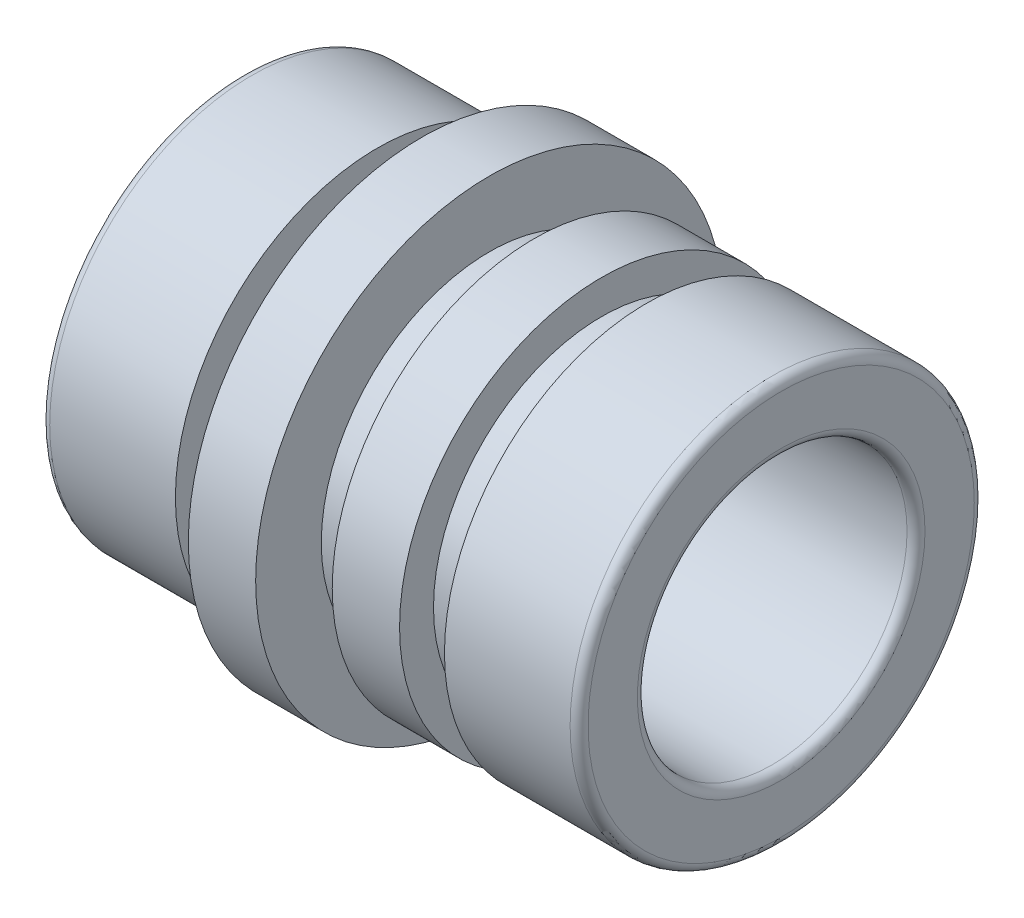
ISO-10303-21;
HEADER;
FILE_DESCRIPTION(('STEP AP214'),'2;1');
FILE_NAME('part.step','',(''),(''),'','','');
FILE_SCHEMA(('AUTOMOTIVE_DESIGN { 1 0 10303 214 1 1 1 1 }'));
ENDSEC;
DATA;
#1=APPLICATION_CONTEXT('core data for automotive mechanical design processes');
#2=APPLICATION_PROTOCOL_DEFINITION('international standard','automotive_design',2000,#1);
#3=PRODUCT_CONTEXT('',#1,'mechanical');
#4=PRODUCT('Part','Part','',(#3));
#5=PRODUCT_RELATED_PRODUCT_CATEGORY('part','',(#4));
#6=PRODUCT_DEFINITION_FORMATION('','',#4);
#7=PRODUCT_DEFINITION_CONTEXT('part definition',#1,'design');
#8=PRODUCT_DEFINITION('design','',#6,#7);
#9=PRODUCT_DEFINITION_SHAPE('','',#8);
#10=(LENGTH_UNIT() NAMED_UNIT(*) SI_UNIT(.MILLI.,.METRE.));
#11=(NAMED_UNIT(*) PLANE_ANGLE_UNIT() SI_UNIT($,.RADIAN.));
#12=(NAMED_UNIT(*) SI_UNIT($,.STERADIAN.) SOLID_ANGLE_UNIT());
#13=UNCERTAINTY_MEASURE_WITH_UNIT(LENGTH_MEASURE(1.E-05),#10,'distance_accuracy_value','');
#14=(GEOMETRIC_REPRESENTATION_CONTEXT(3) GLOBAL_UNCERTAINTY_ASSIGNED_CONTEXT((#13)) GLOBAL_UNIT_ASSIGNED_CONTEXT((#10,
#11,#12)) REPRESENTATION_CONTEXT('',''));
#15=CARTESIAN_POINT('',(0.,0.,0.));
#16=DIRECTION('',(0.,0.,1.));
#17=DIRECTION('',(1.,0.,0.));
#18=AXIS2_PLACEMENT_3D('',#15,#16,#17);
#19=CARTESIAN_POINT('',(-12.7,9.53770000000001,0.));
#20=DIRECTION('',(-1.,0.,0.));
#21=DIRECTION('',(0.,0.,1.));
#22=AXIS2_PLACEMENT_3D('',#19,#20,#21);
#23=PLANE('',#22);
#24=CARTESIAN_POINT('',(-12.7,0.,0.));
#25=DIRECTION('',(-1.,0.,0.));
#26=DIRECTION('',(0.,0.,1.));
#27=AXIS2_PLACEMENT_3D('',#24,#25,#26);
#28=CIRCLE('',#27,13.6398);
#29=CARTESIAN_POINT('',(-12.7,0.,13.6398));
#30=VERTEX_POINT('',#29);
#31=EDGE_CURVE('E38',#30,#30,#28,.T.);
#32=ORIENTED_EDGE('',*,*,#31,.T.);
#33=EDGE_LOOP('',(#32));
#34=FACE_BOUND('',#33,.T.);
#35=CARTESIAN_POINT('',(-12.7,0.,0.));
#36=DIRECTION('',(-1.,0.,0.));
#37=DIRECTION('',(0.,0.,1.));
#38=AXIS2_PLACEMENT_3D('',#35,#36,#37);
#39=CIRCLE('',#38,10.1727);
#40=CARTESIAN_POINT('',(-12.7,0.,10.1727));
#41=VERTEX_POINT('',#40);
#42=EDGE_CURVE('E42',#41,#41,#39,.F.);
#43=ORIENTED_EDGE('',*,*,#42,.T.);
#44=EDGE_LOOP('',(#43));
#45=FACE_BOUND('',#44,.T.);
#46=ADVANCED_FACE('F31',(#34,#45),#23,.T.);
#47=CARTESIAN_POINT('',(-36.83,0.,0.));
#48=DIRECTION('',(-1.,0.,0.));
#49=DIRECTION('',(0.,0.,1.));
#50=AXIS2_PLACEMENT_3D('',#47,#48,#49);
#51=CYLINDRICAL_SURFACE('',#50,9.5377);
#52=CARTESIAN_POINT('',(24.765,0.,0.));
#53=DIRECTION('',(1.,0.,0.));
#54=DIRECTION('',(0.,0.,-1.));
#55=AXIS2_PLACEMENT_3D('',#52,#53,#54);
#56=CIRCLE('',#55,9.5377);
#57=CARTESIAN_POINT('',(24.765,0.,-9.5377));
#58=VERTEX_POINT('',#57);
#59=EDGE_CURVE('E46',#58,#58,#56,.T.);
#60=ORIENTED_EDGE('',*,*,#59,.T.);
#61=EDGE_LOOP('',(#60));
#62=FACE_BOUND('',#61,.T.);
#63=CARTESIAN_POINT('',(-12.065,0.,0.));
#64=DIRECTION('',(-1.,0.,0.));
#65=DIRECTION('',(0.,0.,1.));
#66=AXIS2_PLACEMENT_3D('',#63,#64,#65);
#67=CIRCLE('',#66,9.5377);
#68=CARTESIAN_POINT('',(-12.065,0.,9.5377));
#69=VERTEX_POINT('',#68);
#70=EDGE_CURVE('E51',#69,#69,#67,.T.);
#71=ORIENTED_EDGE('',*,*,#70,.T.);
#72=EDGE_LOOP('',(#71));
#73=FACE_BOUND('',#72,.T.);
#74=ADVANCED_FACE('F117',(#62,#73),#51,.F.);
#75=CARTESIAN_POINT('',(25.4,14.29385,0.));
#76=DIRECTION('',(1.,0.,0.));
#77=DIRECTION('',(0.,0.,-1.));
#78=AXIS2_PLACEMENT_3D('',#75,#76,#77);
#79=PLANE('',#78);
#80=CARTESIAN_POINT('',(25.4,0.,0.));
#81=DIRECTION('',(1.,0.,0.));
#82=DIRECTION('',(0.,0.,-1.));
#83=AXIS2_PLACEMENT_3D('',#80,#81,#82);
#84=CIRCLE('',#83,13.65885);
#85=CARTESIAN_POINT('',(25.4,0.,-13.65885));
#86=VERTEX_POINT('',#85);
#87=EDGE_CURVE('E54',#86,#86,#84,.T.);
#88=ORIENTED_EDGE('',*,*,#87,.T.);
#89=EDGE_LOOP('',(#88));
#90=FACE_BOUND('',#89,.T.);
#91=CARTESIAN_POINT('',(25.4,0.,0.));
#92=DIRECTION('',(1.,0.,0.));
#93=DIRECTION('',(0.,0.,-1.));
#94=AXIS2_PLACEMENT_3D('',#91,#92,#93);
#95=CIRCLE('',#94,10.1727);
#96=CARTESIAN_POINT('',(25.4,0.,-10.1727));
#97=VERTEX_POINT('',#96);
#98=EDGE_CURVE('E57',#97,#97,#95,.F.);
#99=ORIENTED_EDGE('',*,*,#98,.T.);
#100=EDGE_LOOP('',(#99));
#101=FACE_BOUND('',#100,.T.);
#102=ADVANCED_FACE('F122',(#90,#101),#79,.T.);
#103=CARTESIAN_POINT('',(-36.83,0.,0.));
#104=DIRECTION('',(-1.,0.,0.));
#105=DIRECTION('',(0.,0.,1.));
#106=AXIS2_PLACEMENT_3D('',#103,#104,#105);
#107=CYLINDRICAL_SURFACE('',#106,14.29385);
#108=CARTESIAN_POINT('',(24.765,0.,0.));
#109=DIRECTION('',(1.,0.,0.));
#110=DIRECTION('',(0.,0.,-1.));
#111=AXIS2_PLACEMENT_3D('',#108,#109,#110);
#112=CIRCLE('',#111,14.29385);
#113=CARTESIAN_POINT('',(24.765,0.,-14.29385));
#114=VERTEX_POINT('',#113);
#115=EDGE_CURVE('E60',#114,#114,#112,.F.);
#116=ORIENTED_EDGE('',*,*,#115,.T.);
#117=EDGE_LOOP('',(#116));
#118=FACE_BOUND('',#117,.T.);
#119=CARTESIAN_POINT('',(15.875,0.,0.));
#120=DIRECTION('',(-1.,0.,0.));
#121=DIRECTION('',(0.,0.,1.));
#122=AXIS2_PLACEMENT_3D('',#119,#120,#121);
#123=CIRCLE('',#122,14.29385);
#124=CARTESIAN_POINT('',(15.875,0.,14.29385));
#125=VERTEX_POINT('',#124);
#126=EDGE_CURVE('E63',#125,#125,#123,.T.);
#127=ORIENTED_EDGE('',*,*,#126,.F.);
#128=EDGE_LOOP('',(#127));
#129=FACE_BOUND('',#128,.T.);
#130=ADVANCED_FACE('F176',(#118,#129),#107,.T.);
#131=CARTESIAN_POINT('',(15.875,11.89355,0.));
#132=DIRECTION('',(-1.,0.,0.));
#133=DIRECTION('',(0.,0.,1.));
#134=AXIS2_PLACEMENT_3D('',#131,#132,#133);
#135=PLANE('',#134);
#136=ORIENTED_EDGE('',*,*,#126,.T.);
#137=EDGE_LOOP('',(#136));
#138=FACE_BOUND('',#137,.T.);
#139=CARTESIAN_POINT('',(15.875,0.,0.));
#140=DIRECTION('',(-1.,0.,0.));
#141=DIRECTION('',(0.,0.,1.));
#142=AXIS2_PLACEMENT_3D('',#139,#140,#141);
#143=CIRCLE('',#142,11.89355);
#144=CARTESIAN_POINT('',(15.875,0.,11.89355));
#145=VERTEX_POINT('',#144);
#146=EDGE_CURVE('E66',#145,#145,#143,.T.);
#147=ORIENTED_EDGE('',*,*,#146,.F.);
#148=EDGE_LOOP('',(#147));
#149=FACE_BOUND('',#148,.T.);
#150=ADVANCED_FACE('F181',(#138,#149),#135,.T.);
#151=CARTESIAN_POINT('',(-36.83,0.,0.));
#152=DIRECTION('',(-1.,0.,0.));
#153=DIRECTION('',(0.,0.,1.));
#154=AXIS2_PLACEMENT_3D('',#151,#152,#153);
#155=CYLINDRICAL_SURFACE('',#154,11.89355);
#156=ORIENTED_EDGE('',*,*,#146,.T.);
#157=EDGE_LOOP('',(#156));
#158=FACE_BOUND('',#157,.T.);
#159=CARTESIAN_POINT('',(12.7,0.,0.));
#160=DIRECTION('',(-1.,0.,0.));
#161=DIRECTION('',(0.,0.,1.));
#162=AXIS2_PLACEMENT_3D('',#159,#160,#161);
#163=CIRCLE('',#162,11.89355);
#164=CARTESIAN_POINT('',(12.7,0.,11.89355));
#165=VERTEX_POINT('',#164);
#166=EDGE_CURVE('E69',#165,#165,#163,.T.);
#167=ORIENTED_EDGE('',*,*,#166,.F.);
#168=EDGE_LOOP('',(#167));
#169=FACE_BOUND('',#168,.T.);
#170=ADVANCED_FACE('F280',(#158,#169),#155,.T.);
#171=CARTESIAN_POINT('',(12.7,14.29385,0.));
#172=DIRECTION('',(1.,0.,0.));
#173=DIRECTION('',(0.,0.,-1.));
#174=AXIS2_PLACEMENT_3D('',#171,#172,#173);
#175=PLANE('',#174);
#176=ORIENTED_EDGE('',*,*,#166,.T.);
#177=EDGE_LOOP('',(#176));
#178=FACE_BOUND('',#177,.T.);
#179=CARTESIAN_POINT('',(12.7,0.,0.));
#180=DIRECTION('',(-1.,0.,0.));
#181=DIRECTION('',(0.,0.,1.));
#182=AXIS2_PLACEMENT_3D('',#179,#180,#181);
#183=CIRCLE('',#182,14.29385);
#184=CARTESIAN_POINT('',(12.7,0.,14.29385));
#185=VERTEX_POINT('',#184);
#186=EDGE_CURVE('E72',#185,#185,#183,.T.);
#187=ORIENTED_EDGE('',*,*,#186,.F.);
#188=EDGE_LOOP('',(#187));
#189=FACE_BOUND('',#188,.T.);
#190=ADVANCED_FACE('F270',(#178,#189),#175,.T.);
#191=CARTESIAN_POINT('',(-36.83,0.,0.));
#192=DIRECTION('',(-1.,0.,0.));
#193=DIRECTION('',(0.,0.,1.));
#194=AXIS2_PLACEMENT_3D('',#191,#192,#193);
#195=CYLINDRICAL_SURFACE('',#194,14.29385);
#196=ORIENTED_EDGE('',*,*,#186,.T.);
#197=EDGE_LOOP('',(#196));
#198=FACE_BOUND('',#197,.T.);
#199=CARTESIAN_POINT('',(7.9375,0.,0.));
#200=DIRECTION('',(-1.,0.,0.));
#201=DIRECTION('',(0.,0.,1.));
#202=AXIS2_PLACEMENT_3D('',#199,#200,#201);
#203=CIRCLE('',#202,14.29385);
#204=CARTESIAN_POINT('',(7.9375,0.,14.29385));
#205=VERTEX_POINT('',#204);
#206=EDGE_CURVE('E75',#205,#205,#203,.T.);
#207=ORIENTED_EDGE('',*,*,#206,.F.);
#208=EDGE_LOOP('',(#207));
#209=FACE_BOUND('',#208,.T.);
#210=ADVANCED_FACE('F260',(#198,#209),#195,.T.);
#211=CARTESIAN_POINT('',(7.9375,11.89355,0.));
#212=DIRECTION('',(-1.,0.,0.));
#213=DIRECTION('',(0.,0.,1.));
#214=AXIS2_PLACEMENT_3D('',#211,#212,#213);
#215=PLANE('',#214);
#216=ORIENTED_EDGE('',*,*,#206,.T.);
#217=EDGE_LOOP('',(#216));
#218=FACE_BOUND('',#217,.T.);
#219=CARTESIAN_POINT('',(7.9375,0.,0.));
#220=DIRECTION('',(-1.,0.,0.));
#221=DIRECTION('',(0.,0.,1.));
#222=AXIS2_PLACEMENT_3D('',#219,#220,#221);
#223=CIRCLE('',#222,11.89355);
#224=CARTESIAN_POINT('',(7.9375,0.,11.89355));
#225=VERTEX_POINT('',#224);
#226=EDGE_CURVE('E78',#225,#225,#223,.T.);
#227=ORIENTED_EDGE('',*,*,#226,.F.);
#228=EDGE_LOOP('',(#227));
#229=FACE_BOUND('',#228,.T.);
#230=ADVANCED_FACE('F250',(#218,#229),#215,.T.);
#231=CARTESIAN_POINT('',(-36.83,0.,0.));
#232=DIRECTION('',(-1.,0.,0.));
#233=DIRECTION('',(0.,0.,1.));
#234=AXIS2_PLACEMENT_3D('',#231,#232,#233);
#235=CYLINDRICAL_SURFACE('',#234,11.89355);
#236=ORIENTED_EDGE('',*,*,#226,.T.);
#237=EDGE_LOOP('',(#236));
#238=FACE_BOUND('',#237,.T.);
#239=CARTESIAN_POINT('',(4.7625,0.,0.));
#240=DIRECTION('',(-1.,0.,0.));
#241=DIRECTION('',(0.,0.,1.));
#242=AXIS2_PLACEMENT_3D('',#239,#240,#241);
#243=CIRCLE('',#242,11.89355);
#244=CARTESIAN_POINT('',(4.7625,0.,11.89355));
#245=VERTEX_POINT('',#244);
#246=EDGE_CURVE('E81',#245,#245,#243,.T.);
#247=ORIENTED_EDGE('',*,*,#246,.F.);
#248=EDGE_LOOP('',(#247));
#249=FACE_BOUND('',#248,.T.);
#250=ADVANCED_FACE('F240',(#238,#249),#235,.T.);
#251=CARTESIAN_POINT('',(4.7625,16.5354,0.));
#252=DIRECTION('',(1.,0.,0.));
#253=DIRECTION('',(0.,0.,-1.));
#254=AXIS2_PLACEMENT_3D('',#251,#252,#253);
#255=PLANE('',#254);
#256=ORIENTED_EDGE('',*,*,#246,.T.);
#257=EDGE_LOOP('',(#256));
#258=FACE_BOUND('',#257,.T.);
#259=CARTESIAN_POINT('',(4.7625,0.,0.));
#260=DIRECTION('',(-1.,0.,0.));
#261=DIRECTION('',(0.,0.,1.));
#262=AXIS2_PLACEMENT_3D('',#259,#260,#261);
#263=CIRCLE('',#262,16.5354);
#264=CARTESIAN_POINT('',(4.7625,0.,16.5354));
#265=VERTEX_POINT('',#264);
#266=EDGE_CURVE('E84',#265,#265,#263,.T.);
#267=ORIENTED_EDGE('',*,*,#266,.F.);
#268=EDGE_LOOP('',(#267));
#269=FACE_BOUND('',#268,.T.);
#270=ADVANCED_FACE('F230',(#258,#269),#255,.T.);
#271=CARTESIAN_POINT('',(-36.83,0.,0.));
#272=DIRECTION('',(-1.,0.,0.));
#273=DIRECTION('',(0.,0.,1.));
#274=AXIS2_PLACEMENT_3D('',#271,#272,#273);
#275=CYLINDRICAL_SURFACE('',#274,16.5354);
#276=ORIENTED_EDGE('',*,*,#266,.T.);
#277=EDGE_LOOP('',(#276));
#278=FACE_BOUND('',#277,.T.);
#279=CARTESIAN_POINT('',(0.,0.,0.));
#280=DIRECTION('',(-1.,0.,0.));
#281=DIRECTION('',(0.,0.,1.));
#282=AXIS2_PLACEMENT_3D('',#279,#280,#281);
#283=CIRCLE('',#282,16.5354);
#284=CARTESIAN_POINT('',(0.,0.,16.5354));
#285=VERTEX_POINT('',#284);
#286=EDGE_CURVE('E87',#285,#285,#283,.T.);
#287=ORIENTED_EDGE('',*,*,#286,.F.);
#288=EDGE_LOOP('',(#287));
#289=FACE_BOUND('',#288,.T.);
#290=ADVANCED_FACE('F220',(#278,#289),#275,.T.);
#291=CARTESIAN_POINT('',(0.,11.89355,0.));
#292=DIRECTION('',(-1.,0.,0.));
#293=DIRECTION('',(0.,0.,1.));
#294=AXIS2_PLACEMENT_3D('',#291,#292,#293);
#295=PLANE('',#294);
#296=ORIENTED_EDGE('',*,*,#286,.T.);
#297=EDGE_LOOP('',(#296));
#298=FACE_BOUND('',#297,.T.);
#299=CARTESIAN_POINT('',(0.,0.,0.));
#300=DIRECTION('',(-1.,0.,0.));
#301=DIRECTION('',(0.,0.,1.));
#302=AXIS2_PLACEMENT_3D('',#299,#300,#301);
#303=CIRCLE('',#302,11.89355);
#304=CARTESIAN_POINT('',(0.,0.,11.89355));
#305=VERTEX_POINT('',#304);
#306=EDGE_CURVE('E90',#305,#305,#303,.T.);
#307=ORIENTED_EDGE('',*,*,#306,.F.);
#308=EDGE_LOOP('',(#307));
#309=FACE_BOUND('',#308,.T.);
#310=ADVANCED_FACE('F113',(#298,#309),#295,.T.);
#311=CARTESIAN_POINT('',(-36.83,0.,0.));
#312=DIRECTION('',(-1.,0.,0.));
#313=DIRECTION('',(0.,0.,1.));
#314=AXIS2_PLACEMENT_3D('',#311,#312,#313);
#315=CYLINDRICAL_SURFACE('',#314,11.89355);
#316=ORIENTED_EDGE('',*,*,#306,.T.);
#317=EDGE_LOOP('',(#316));
#318=FACE_BOUND('',#317,.T.);
#319=CARTESIAN_POINT('',(-3.175,0.,0.));
#320=DIRECTION('',(-1.,0.,0.));
#321=DIRECTION('',(0.,0.,1.));
#322=AXIS2_PLACEMENT_3D('',#319,#320,#321);
#323=CIRCLE('',#322,11.89355);
#324=CARTESIAN_POINT('',(-3.175,0.,11.89355));
#325=VERTEX_POINT('',#324);
#326=EDGE_CURVE('E93',#325,#325,#323,.T.);
#327=ORIENTED_EDGE('',*,*,#326,.F.);
#328=EDGE_LOOP('',(#327));
#329=FACE_BOUND('',#328,.T.);
#330=ADVANCED_FACE('F104',(#318,#329),#315,.T.);
#331=CARTESIAN_POINT('',(-3.175,14.2748,0.));
#332=DIRECTION('',(1.,0.,0.));
#333=DIRECTION('',(0.,0.,-1.));
#334=AXIS2_PLACEMENT_3D('',#331,#332,#333);
#335=PLANE('',#334);
#336=ORIENTED_EDGE('',*,*,#326,.T.);
#337=EDGE_LOOP('',(#336));
#338=FACE_BOUND('',#337,.T.);
#339=CARTESIAN_POINT('',(-3.175,0.,0.));
#340=DIRECTION('',(-1.,0.,0.));
#341=DIRECTION('',(0.,0.,1.));
#342=AXIS2_PLACEMENT_3D('',#339,#340,#341);
#343=CIRCLE('',#342,14.2748);
#344=CARTESIAN_POINT('',(-3.175,0.,14.2748));
#345=VERTEX_POINT('',#344);
#346=EDGE_CURVE('E96',#345,#345,#343,.T.);
#347=ORIENTED_EDGE('',*,*,#346,.F.);
#348=EDGE_LOOP('',(#347));
#349=FACE_BOUND('',#348,.T.);
#350=ADVANCED_FACE('F102',(#338,#349),#335,.T.);
#351=CARTESIAN_POINT('',(-36.83,0.,0.));
#352=DIRECTION('',(-1.,0.,0.));
#353=DIRECTION('',(0.,0.,1.));
#354=AXIS2_PLACEMENT_3D('',#351,#352,#353);
#355=CYLINDRICAL_SURFACE('',#354,14.2748);
#356=CARTESIAN_POINT('',(-12.065,0.,0.));
#357=DIRECTION('',(-1.,0.,0.));
#358=DIRECTION('',(0.,0.,1.));
#359=AXIS2_PLACEMENT_3D('',#356,#357,#358);
#360=CIRCLE('',#359,14.2748);
#361=CARTESIAN_POINT('',(-12.065,0.,14.2748));
#362=VERTEX_POINT('',#361);
#363=EDGE_CURVE('E10',#362,#362,#360,.F.);
#364=ORIENTED_EDGE('',*,*,#363,.T.);
#365=EDGE_LOOP('',(#364));
#366=FACE_BOUND('',#365,.T.);
#367=ORIENTED_EDGE('',*,*,#346,.T.);
#368=EDGE_LOOP('',(#367));
#369=FACE_BOUND('',#368,.T.);
#370=ADVANCED_FACE('F100',(#366,#369),#355,.T.);
#371=CARTESIAN_POINT('',(24.765,0.,0.));
#372=DIRECTION('',(1.,0.,0.));
#373=DIRECTION('',(0.,0.,-1.));
#374=AXIS2_PLACEMENT_3D('',#371,#372,#373);
#375=TOROIDAL_SURFACE('',#374,13.65885,0.635);
#376=ORIENTED_EDGE('',*,*,#87,.F.);
#377=EDGE_LOOP('',(#376));
#378=FACE_BOUND('',#377,.T.);
#379=ORIENTED_EDGE('',*,*,#115,.F.);
#380=EDGE_LOOP('',(#379));
#381=FACE_BOUND('',#380,.T.);
#382=ADVANCED_FACE('F111',(#378,#381),#375,.T.);
#383=CARTESIAN_POINT('',(24.765,0.,0.));
#384=DIRECTION('',(1.,0.,0.));
#385=DIRECTION('',(0.,0.,-1.));
#386=AXIS2_PLACEMENT_3D('',#383,#384,#385);
#387=TOROIDAL_SURFACE('',#386,10.1727,0.635);
#388=ORIENTED_EDGE('',*,*,#59,.F.);
#389=EDGE_LOOP('',(#388));
#390=FACE_BOUND('',#389,.T.);
#391=ORIENTED_EDGE('',*,*,#98,.F.);
#392=EDGE_LOOP('',(#391));
#393=FACE_BOUND('',#392,.T.);
#394=ADVANCED_FACE('F130',(#390,#393),#387,.T.);
#395=CARTESIAN_POINT('',(-12.065,0.,0.));
#396=DIRECTION('',(-1.,0.,0.));
#397=DIRECTION('',(0.,0.,1.));
#398=AXIS2_PLACEMENT_3D('',#395,#396,#397);
#399=TOROIDAL_SURFACE('',#398,13.6398,0.635);
#400=ORIENTED_EDGE('',*,*,#363,.F.);
#401=EDGE_LOOP('',(#400));
#402=FACE_BOUND('',#401,.T.);
#403=ORIENTED_EDGE('',*,*,#31,.F.);
#404=EDGE_LOOP('',(#403));
#405=FACE_BOUND('',#404,.T.);
#406=ADVANCED_FACE('F133',(#402,#405),#399,.T.);
#407=CARTESIAN_POINT('',(-12.065,0.,0.));
#408=DIRECTION('',(-1.,0.,0.));
#409=DIRECTION('',(0.,0.,1.));
#410=AXIS2_PLACEMENT_3D('',#407,#408,#409);
#411=TOROIDAL_SURFACE('',#410,10.1727,0.635);
#412=ORIENTED_EDGE('',*,*,#42,.F.);
#413=EDGE_LOOP('',(#412));
#414=FACE_BOUND('',#413,.T.);
#415=ORIENTED_EDGE('',*,*,#70,.F.);
#416=EDGE_LOOP('',(#415));
#417=FACE_BOUND('',#416,.T.);
#418=ADVANCED_FACE('F33',(#414,#417),#411,.T.);
#419=CLOSED_SHELL('',(#46,#74,#102,#130,#150,#170,#190,#210,#230,#250,#270,#290,#310,#330,#350,
#370,#382,#394,#406,#418));
#420=MANIFOLD_SOLID_BREP('B2',#419);
#421=ADVANCED_BREP_SHAPE_REPRESENTATION('',(#18,#420),#14);
#422=SHAPE_DEFINITION_REPRESENTATION(#9,#421);
ENDSEC;
END-ISO-10303-21;
